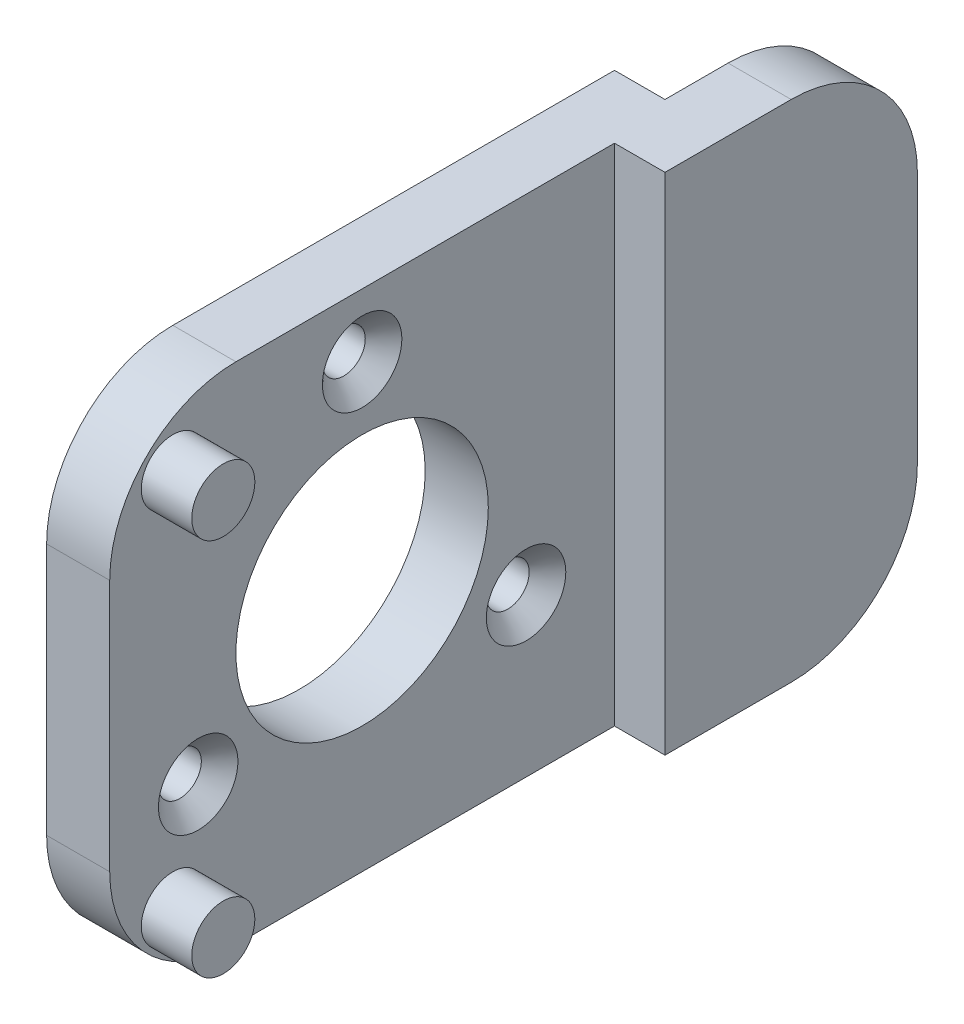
from build123d import *

# Parameters (mm, degrees)
SKETCH1_R                                       = 10
BOSS_EXTRUDE1_DEPTH                             = 5
CSK_FOR_M3_FLAT_HEAD_MACHINE_SCREW1_D           = 3.4
CSK_FOR_M3_FLAT_HEAD_MACHINE_SCREW1_CSINK_D     = 6.3
CSK_FOR_M3_FLAT_HEAD_MACHINE_SCREW1_CSINK_ANGLE = 90
SKETCH4_W                                       = 5
SKETCH4_H                                       = 40
BOSS_EXTRUDE2_DEPTH                             = 9
SKETCH5_W                                       = 5
SKETCH5_H                                       = 40
BOSS_EXTRUDE3_DEPTH                             = 15
FILLET2_R                                       = 10
SKETCH6_R                                       = 2.5
BOSS_EXTRUDE4_DEPTH                             = 4


with BuildPart() as part:
    # Sketch1 → Boss-Extrude1 (new body)
    with BuildSketch(Plane(origin=(0, 0, 0), x_dir=(0, 0, -1), z_dir=(1, 0, 0))):
        with BuildLine():
            Line((10, 20), (20, 20))
            Line((20, 20), (20, 10))
            Line((20, 10), (20, -10))
            Line((20, -10), (20, -20))
            Line((20, -20), (10, -20))
            Line((10, -20), (-10, -20))
            ThreePointArc((-10, -20), (-17.071067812, -17.071067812), (-20, -10))
            Line((-20, -10), (-20, 10))
            ThreePointArc((-20, 10), (-17.071067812, 17.071067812), (-10, 20))
            Line((-10, 20), (10, 20))
        make_face()
        Circle(SKETCH1_R, mode=Mode.SUBTRACT)
    extrude(amount=BOSS_EXTRUDE1_DEPTH)

    # CSK for M3 Flat Head Machine Screw1 (through all)
    with Locations(Plane(origin=(5, 0, 0), x_dir=(0, 0, -1), z_dir=(1, 0, 0))):
        with Locations((0, 15), (12.990381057, -7.5), (-12.990381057, -7.5)):
            CounterSinkHole(CSK_FOR_M3_FLAT_HEAD_MACHINE_SCREW1_D / 2, CSK_FOR_M3_FLAT_HEAD_MACHINE_SCREW1_CSINK_D / 2, counter_sink_angle=CSK_FOR_M3_FLAT_HEAD_MACHINE_SCREW1_CSINK_ANGLE)

    # Sketch4 → Boss-Extrude2 (add)
    with BuildSketch(Plane.ZY):
        with Locations((-22.5, 0)):
            Rectangle(SKETCH4_W, SKETCH4_H)
    extrude(amount=-BOSS_EXTRUDE2_DEPTH)

    # Sketch5 → Boss-Extrude3 (add)
    with BuildSketch(Plane(origin=(0, 0, -25), x_dir=(-1, 0, 0), z_dir=(0, 0, -1))):
        with Locations((-6.5, 0)):
            Rectangle(SKETCH5_W, SKETCH5_H)
    extrude(amount=BOSS_EXTRUDE3_DEPTH)

    # Fillet2
    fillet2_edges = [part.edges().sort_by_distance(p)[0] for p in [
        (6.5, 20, -40),
        (6.5, -20, -40),
    ]]
    fillet(fillet2_edges, radius=FILLET2_R)

    # Sketch6 → Boss-Extrude4 (add)
    with BuildSketch(Plane(origin=(5, 0, 0), x_dir=(0, 0, -1), z_dir=(1, 0, 0))):
        with Locations((-15, -15)):
            Circle(SKETCH6_R)
        with Locations((-15, 15)):
            Circle(SKETCH6_R)
    extrude(amount=BOSS_EXTRUDE4_DEPTH)


solid = part.part
